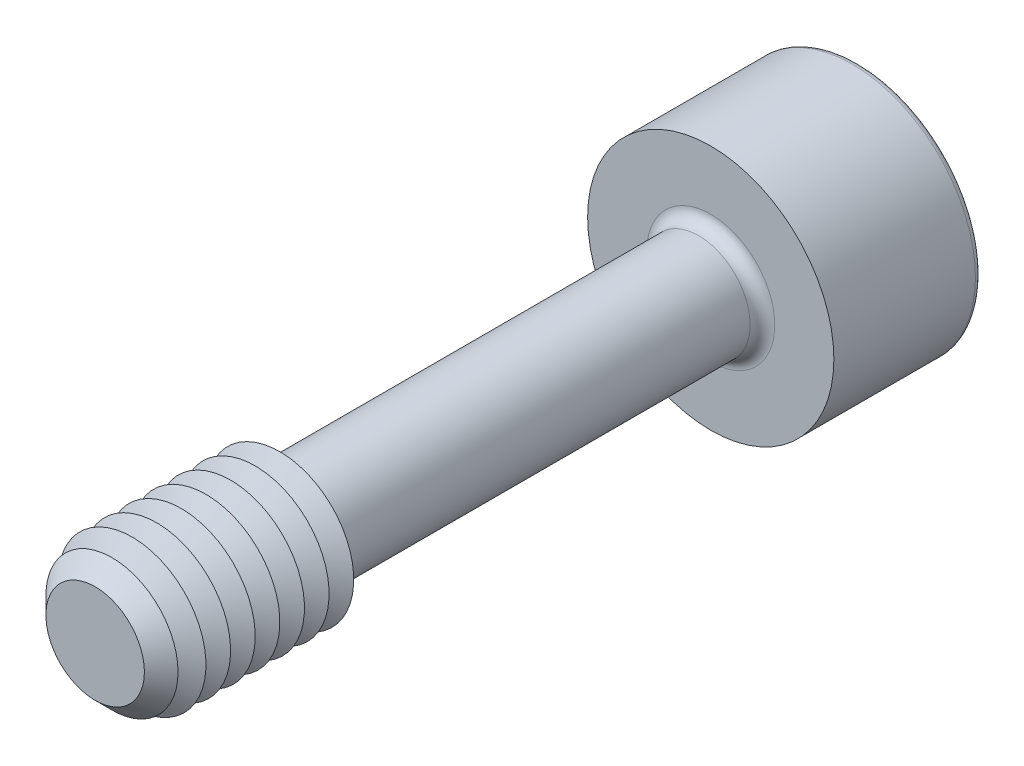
from build123d import *

# Parameters (mm, degrees)
SKETCH1_R       = 2.1
EXTRUDE1_DEPTH  = 12.5
CHAMFER1_SIZE   = 1
SKETCH3_R       = 5
EXTRUDE2_DEPTH  = 6
EXTRUDE3_DEPTH  = 5
FILLET1_R       = 0.5
FILLET2_R       = 0.25
LPATTERN1_COUNT = 7
LPATTERN1_PITCH = 1


with BuildPart() as part:
    # Sketch1 → Extrude1 (new, symmetric)
    with BuildSketch(Plane.XY):
        Circle(SKETCH1_R)
    extrude(amount=EXTRUDE1_DEPTH, both=True)

    # Sketch2 → Revolve1 (revolve)
    with BuildSketch(Plane(origin=(0, 0, 0), x_dir=(0, 0, -1), z_dir=(1, 0, 0))):
        Polygon((-12.5, 0), (-12.5, 3), (-5, 3), (-4.480384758, 2.1), (-4.480384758, 0), align=None)
    revolve(axis=Axis((0, 0, 4.480384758), (0, 0, 1)))

    # Chamfer1
    chamfer1_edges = [part.edges().sort_by_distance(p)[0] for p in [
        (0, -3, 12.5),
    ]]
    chamfer(chamfer1_edges, length=CHAMFER1_SIZE)

    # Sketch3 → Extrude2 (add)
    with BuildSketch(Plane(origin=(0, 0, -12.5), x_dir=(-1, 0, 0), z_dir=(0, 0, -1))):
        Circle(SKETCH3_R)
    extrude(amount=EXTRUDE2_DEPTH)

    # Sketch4 → Extrude3 (cut)
    with BuildSketch(Plane(origin=(-13.7, 0, -18.5), x_dir=(1, 0, 0), z_dir=(0, 0, 1))):
        Polygon((12.256624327, -2.5), (15.143375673, -2.5), (16.586751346, 0), (15.143375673, 2.5), (12.256624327, 2.5), (10.813248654, 0), align=None)
    extrude(amount=EXTRUDE3_DEPTH, mode=Mode.SUBTRACT)

    # Fillet1
    fillet1_edges = [part.edges().sort_by_distance(p)[0] for p in [
        (-2.1, 0, -12.5),
    ]]
    fillet(fillet1_edges, radius=FILLET1_R)

    # Fillet2
    fillet2_edges = [part.edges().sort_by_distance(p)[0] for p in [
        (5, 0, -18.5),
    ]]
    fillet(fillet2_edges, radius=FILLET2_R)

    # Sketch5 → Cut-Revolve1 (revolve, cut)
    with BuildSketch(Plane(origin=(0, 0, 0), x_dir=(0, 0, -1), z_dir=(1, 0, 0)), mode=Mode.PRIVATE) as cut_revolve1_sk:
        Polygon((13.5, 0), (13.5, -2.5), (12.056624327, 0), align=None)
    revolve(cut_revolve1_sk.sketch.rotate(Axis((0, 0, -12.056624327), (0, 0, -1)), 90), axis=Axis((0, 0, -12.056624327), (0, 0, -1)), mode=Mode.SUBTRACT)

    # Sketch7 → Cut-Revolve2 (revolve, cut)
    with BuildSketch(Plane(origin=(0, 0, 0), x_dir=(0, 0, -1), z_dir=(1, 0, 0)), mode=Mode.PRIVATE) as cut_revolve2_sk:
        Polygon((-5, 3), (-5.5, 2.133974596), (-6, 3), align=None)
    cut_revolve2 = revolve(cut_revolve2_sk.sketch.rotate(Axis((0, 0, -1.332048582), (0, 0, 1)), 90), axis=Axis((0, 0, -1.332048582), (0, 0, 1)), mode=Mode.SUBTRACT)

    # LPattern1: Cut-Revolve2 ×7
    with Locations(*[(0, 0, i * LPATTERN1_PITCH) for i in range(1, LPATTERN1_COUNT)]):
        add(cut_revolve2, mode=Mode.SUBTRACT)


solid = part.part
